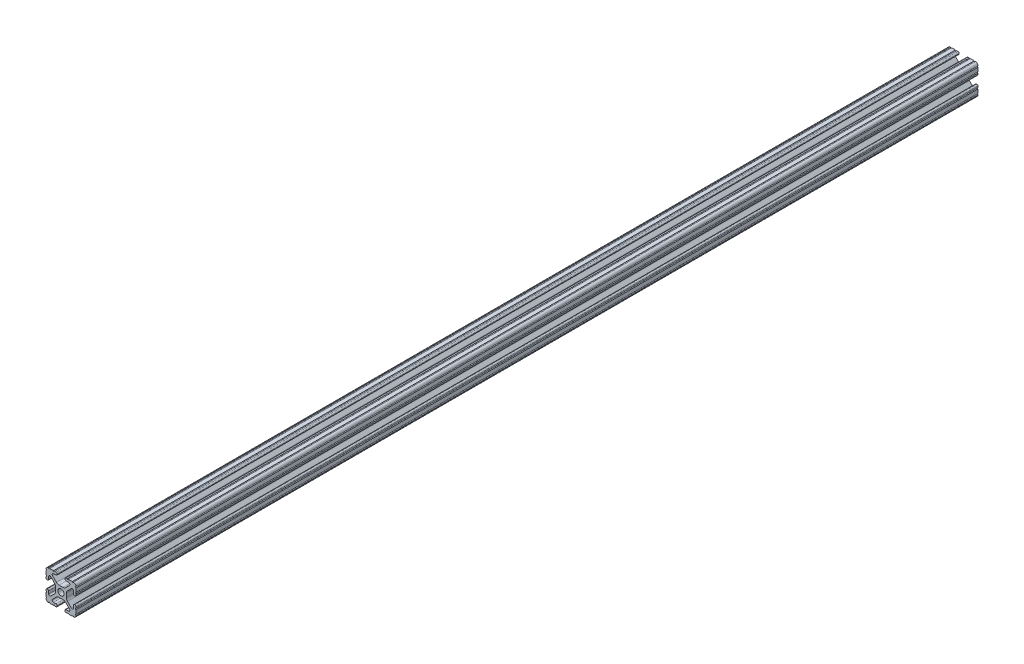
from build123d import *

# Parameters (mm, degrees)
SKETCH1_R      = 2.6035
EXTRUDE1_DEPTH = 762


with BuildPart() as part:
    # Sketch1 → Extrude1 (new body)
    with BuildSketch(Plane.XY):
        with BuildLine():
            Line((-7.207036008, 8.724370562), (-3.898272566, 5.423169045))
            ThreePointArc((-3.898272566, 5.423169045), (-2.869120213, 4.736787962), (-1.655778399, 4.4958))
            Line((-1.655778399, 4.4958), (1.655778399, 4.4958))
            ThreePointArc((1.655778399, 4.4958), (2.869120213, 4.736787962), (3.898272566, 5.423169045))
            Line((3.898272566, 5.423169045), (7.207036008, 8.724370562))
            ThreePointArc((7.207036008, 8.724370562), (7.432222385, 9.85140422), (6.476788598, 10.4902))
            Line((6.476788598, 10.4902), (4.287512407, 10.4902))
            ThreePointArc((4.287512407, 10.4902), (3.54574862, 10.79744862), (3.2385, 11.539212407))
            Line((3.2385, 11.539212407), (3.2385, 11.650987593))
            ThreePointArc((3.2385, 11.650987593), (3.54574862, 12.39275138), (4.287512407, 12.7))
            Line((4.287512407, 12.7), (5.317126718, 12.7))
            ThreePointArc((5.317126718, 12.7), (5.825126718, 12.192), (6.333126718, 12.7))
            Line((6.333126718, 12.7), (9.550443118, 12.7))
            ThreePointArc((9.550443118, 12.7), (10.058366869, 12.192000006), (10.566443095, 12.699847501))
            ThreePointArc((10.566443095, 12.699847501), (12.082537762, 12.08250727), (12.699846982, 10.566399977))
            ThreePointArc((12.699846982, 10.566399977), (12.192000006, 10.058323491), (12.7, 9.5504))
            Line((12.7, 9.5504), (12.7, 6.3330836))
            ThreePointArc((12.7, 6.3330836), (12.192, 5.8250836), (12.7, 5.3170836))
            Line((12.7, 5.3170836), (12.7, 4.287469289))
            ThreePointArc((12.7, 4.287469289), (12.39275138, 3.545705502), (11.650987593, 3.238456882))
            Line((11.650987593, 3.238456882), (11.539212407, 3.238456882))
            ThreePointArc((11.539212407, 3.238456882), (10.79744862, 3.545705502), (10.4902, 4.287469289))
            Line((10.4902, 4.287469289), (10.4902, 6.402089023))
            ThreePointArc((10.4902, 6.402089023), (9.856505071, 7.351067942), (8.737131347, 7.129408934))
            Line((8.737131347, 7.129408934), (5.441005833, 3.840816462))
            ThreePointArc((5.441005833, 3.840816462), (4.750877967, 2.809883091), (4.5085, 1.593185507))
            Line((4.5085, 1.593185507), (4.5085, -1.593185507))
            ThreePointArc((4.5085, -1.593185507), (4.750877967, -2.809883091), (5.441005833, -3.840816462))
            Line((5.441005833, -3.840816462), (8.737131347, -7.129408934))
            ThreePointArc((8.737131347, -7.129408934), (9.856505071, -7.351067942), (10.4902, -6.402089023))
            Line((10.4902, -6.402089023), (10.4902, -4.287469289))
            ThreePointArc((10.4902, -4.287469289), (10.79744862, -3.545705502), (11.539212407, -3.238456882))
            Line((11.539212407, -3.238456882), (11.650987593, -3.238456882))
            ThreePointArc((11.650987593, -3.238456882), (12.39275138, -3.545705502), (12.7, -4.287469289))
            Line((12.7, -4.287469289), (12.7, -5.3170836))
            ThreePointArc((12.7, -5.3170836), (12.192, -5.8250836), (12.7, -6.3330836))
            Line((12.7, -6.3330836), (12.7, -9.5504))
            ThreePointArc((12.7, -9.5504), (12.192000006, -10.058323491), (12.699846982, -10.566399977))
            ThreePointArc((12.699846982, -10.566399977), (12.082537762, -12.08250727), (10.566443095, -12.699847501))
            ThreePointArc((10.566443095, -12.699847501), (10.058366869, -12.192000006), (9.550443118, -12.7))
            Line((9.550443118, -12.7), (6.333126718, -12.7))
            ThreePointArc((6.333126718, -12.7), (5.825126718, -12.192), (5.317126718, -12.7))
            Line((5.317126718, -12.7), (4.287512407, -12.7))
            ThreePointArc((4.287512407, -12.7), (3.54574862, -12.39275138), (3.2385, -11.650987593))
            Line((3.2385, -11.650987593), (3.2385, -11.539212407))
            ThreePointArc((3.2385, -11.539212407), (3.54574862, -10.79744862), (4.287512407, -10.4902))
            Line((4.287512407, -10.4902), (6.416408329, -10.4902))
            ThreePointArc((6.416408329, -10.4902), (7.41473083, -9.822813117), (7.179650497, -8.645192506))
            Line((7.179650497, -8.645192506), (3.952270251, -5.423690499))
            ThreePointArc((3.952270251, -5.423690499), (2.922936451, -4.736929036), (1.709253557, -4.4958))
            Line((1.709253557, -4.4958), (-1.709253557, -4.4958))
            ThreePointArc((-1.709253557, -4.4958), (-2.922936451, -4.736929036), (-3.952270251, -5.423690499))
            Line((-3.952270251, -5.423690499), (-7.179650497, -8.645192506))
            ThreePointArc((-7.179650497, -8.645192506), (-7.41473083, -9.822813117), (-6.416408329, -10.4902))
            Line((-6.416408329, -10.4902), (-4.287512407, -10.4902))
            ThreePointArc((-4.287512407, -10.4902), (-3.54574862, -10.79744862), (-3.2385, -11.539212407))
            Line((-3.2385, -11.539212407), (-3.2385, -11.650987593))
            ThreePointArc((-3.2385, -11.650987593), (-3.54574862, -12.39275138), (-4.287512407, -12.7))
            Line((-4.287512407, -12.7), (-5.317126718, -12.7))
            ThreePointArc((-5.317126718, -12.7), (-5.825126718, -12.192), (-6.333126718, -12.7))
            Line((-6.333126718, -12.7), (-9.550443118, -12.7))
            ThreePointArc((-9.550443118, -12.7), (-10.058366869, -12.192000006), (-10.566443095, -12.699847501))
            ThreePointArc((-10.566443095, -12.699847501), (-12.082537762, -12.08250727), (-12.699846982, -10.566399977))
            ThreePointArc((-12.699846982, -10.566399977), (-12.192000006, -10.058323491), (-12.7, -9.5504))
            Line((-12.7, -9.5504), (-12.7, -6.3330836))
            ThreePointArc((-12.7, -6.3330836), (-12.192, -5.8250836), (-12.7, -5.3170836))
            Line((-12.7, -5.3170836), (-12.7, -4.287469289))
            ThreePointArc((-12.7, -4.287469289), (-12.39275138, -3.545705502), (-11.650987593, -3.238456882))
            Line((-11.650987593, -3.238456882), (-11.539212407, -3.238456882))
            ThreePointArc((-11.539212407, -3.238456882), (-10.79744862, -3.545705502), (-10.4902, -4.287469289))
            Line((-10.4902, -4.287469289), (-10.4902, -6.402089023))
            ThreePointArc((-10.4902, -6.402089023), (-9.856505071, -7.351067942), (-8.737131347, -7.129408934))
            Line((-8.737131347, -7.129408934), (-5.441005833, -3.840816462))
            ThreePointArc((-5.441005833, -3.840816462), (-4.750877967, -2.809883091), (-4.5085, -1.593185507))
            Line((-4.5085, -1.593185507), (-4.5085, 1.593185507))
            ThreePointArc((-4.5085, 1.593185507), (-4.750877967, 2.809883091), (-5.441005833, 3.840816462))
            Line((-5.441005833, 3.840816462), (-8.737131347, 7.129408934))
            ThreePointArc((-8.737131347, 7.129408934), (-9.856505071, 7.351067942), (-10.4902, 6.402089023))
            Line((-10.4902, 6.402089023), (-10.4902, 4.287469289))
            ThreePointArc((-10.4902, 4.287469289), (-10.79744862, 3.545705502), (-11.539212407, 3.238456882))
            Line((-11.539212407, 3.238456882), (-11.650987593, 3.238456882))
            ThreePointArc((-11.650987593, 3.238456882), (-12.39275138, 3.545705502), (-12.7, 4.287469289))
            Line((-12.7, 4.287469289), (-12.7, 5.3170836))
            ThreePointArc((-12.7, 5.3170836), (-12.192, 5.8250836), (-12.7, 6.3330836))
            Line((-12.7, 6.3330836), (-12.7, 9.5504))
            ThreePointArc((-12.7, 9.5504), (-12.192000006, 10.058323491), (-12.699846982, 10.566399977))
            ThreePointArc((-12.699846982, 10.566399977), (-12.082537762, 12.08250727), (-10.566443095, 12.699847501))
            ThreePointArc((-10.566443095, 12.699847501), (-10.058366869, 12.192000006), (-9.550443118, 12.7))
            Line((-9.550443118, 12.7), (-6.333126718, 12.7))
            ThreePointArc((-6.333126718, 12.7), (-5.825126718, 12.192), (-5.317126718, 12.7))
            Line((-5.317126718, 12.7), (-4.287512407, 12.7))
            ThreePointArc((-4.287512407, 12.7), (-3.54574862, 12.39275138), (-3.2385, 11.650987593))
            Line((-3.2385, 11.650987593), (-3.2385, 11.539212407))
            ThreePointArc((-3.2385, 11.539212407), (-3.54574862, 10.79744862), (-4.287512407, 10.4902))
            Line((-4.287512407, 10.4902), (-6.476788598, 10.4902))
            ThreePointArc((-6.476788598, 10.4902), (-7.432222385, 9.85140422), (-7.207036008, 8.724370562))
        make_face()
        Circle(SKETCH1_R, mode=Mode.SUBTRACT)
    extrude(amount=-EXTRUDE1_DEPTH)


solid = part.part
